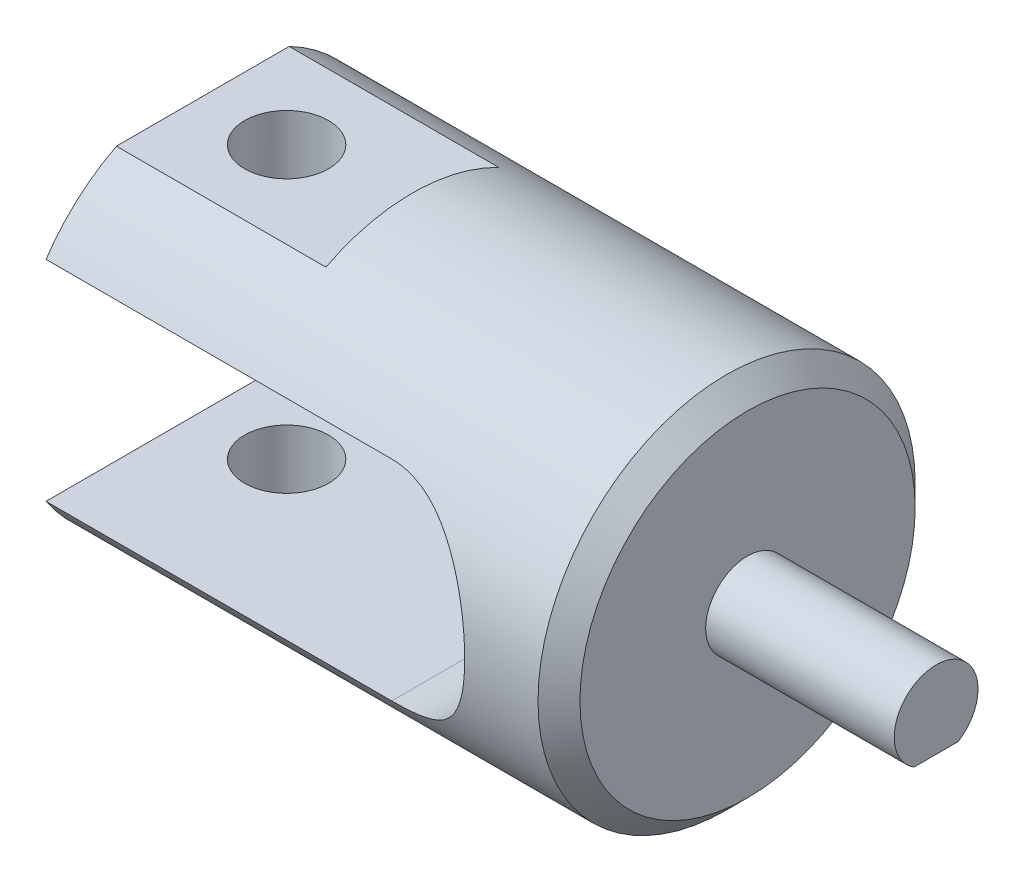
ISO-10303-21;
HEADER;
FILE_DESCRIPTION(('STEP AP214'),'2;1');
FILE_NAME('part.step','',(''),(''),'','','');
FILE_SCHEMA(('AUTOMOTIVE_DESIGN { 1 0 10303 214 1 1 1 1 }'));
ENDSEC;
DATA;
#1=APPLICATION_CONTEXT('core data for automotive mechanical design processes');
#2=APPLICATION_PROTOCOL_DEFINITION('international standard','automotive_design',2000,#1);
#3=PRODUCT_CONTEXT('',#1,'mechanical');
#4=PRODUCT('Part','Part','',(#3));
#5=PRODUCT_RELATED_PRODUCT_CATEGORY('part','',(#4));
#6=PRODUCT_DEFINITION_FORMATION('','',#4);
#7=PRODUCT_DEFINITION_CONTEXT('part definition',#1,'design');
#8=PRODUCT_DEFINITION('design','',#6,#7);
#9=PRODUCT_DEFINITION_SHAPE('','',#8);
#10=(LENGTH_UNIT() NAMED_UNIT(*) SI_UNIT(.MILLI.,.METRE.));
#11=(NAMED_UNIT(*) PLANE_ANGLE_UNIT() SI_UNIT($,.RADIAN.));
#12=(NAMED_UNIT(*) SI_UNIT($,.STERADIAN.) SOLID_ANGLE_UNIT());
#13=UNCERTAINTY_MEASURE_WITH_UNIT(LENGTH_MEASURE(1.E-05),#10,'distance_accuracy_value','');
#14=(GEOMETRIC_REPRESENTATION_CONTEXT(3) GLOBAL_UNCERTAINTY_ASSIGNED_CONTEXT((#13)) GLOBAL_UNIT_ASSIGNED_CONTEXT((#10,
#11,#12)) REPRESENTATION_CONTEXT('',''));
#15=CARTESIAN_POINT('',(0.,0.,0.));
#16=DIRECTION('',(0.,0.,1.));
#17=DIRECTION('',(1.,0.,0.));
#18=AXIS2_PLACEMENT_3D('',#15,#16,#17);
#19=CARTESIAN_POINT('',(-46.1378907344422,0.,0.));
#20=DIRECTION('',(1.,0.,0.));
#21=DIRECTION('',(0.,0.,-1.));
#22=AXIS2_PLACEMENT_3D('',#19,#20,#21);
#23=PLANE('',#22);
#24=DIRECTION('',(0.,0.,-1.));
#25=VECTOR('',#24,1.);
#26=CARTESIAN_POINT('',(-46.1378907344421,-8.,9.));
#27=LINE('',#26,#25);
#28=CARTESIAN_POINT('',(-46.1378907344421,-8.,4.12310562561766));
#29=VERTEX_POINT('',#28);
#30=CARTESIAN_POINT('',(-46.1378907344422,-8.,-4.12310562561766));
#31=VERTEX_POINT('',#30);
#32=EDGE_CURVE('E59',#29,#31,#27,.T.);
#33=ORIENTED_EDGE('',*,*,#32,.F.);
#34=CARTESIAN_POINT('',(-46.1378907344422,0.,0.));
#35=DIRECTION('',(-1.,0.,0.));
#36=DIRECTION('',(0.,0.,1.));
#37=AXIS2_PLACEMENT_3D('',#34,#35,#36);
#38=CIRCLE('',#37,9.);
#39=CARTESIAN_POINT('',(-46.1378907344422,-5.,7.48331477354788));
#40=VERTEX_POINT('',#39);
#41=EDGE_CURVE('E145',#29,#40,#38,.T.);
#42=ORIENTED_EDGE('',*,*,#41,.T.);
#43=DIRECTION('',(0.,0.,-1.));
#44=VECTOR('',#43,1.);
#45=CARTESIAN_POINT('',(-46.1378907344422,-5.,9.));
#46=LINE('',#45,#44);
#47=CARTESIAN_POINT('',(-46.1378907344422,-5.,-7.48331477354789));
#48=VERTEX_POINT('',#47);
#49=EDGE_CURVE('E142',#40,#48,#46,.T.);
#50=ORIENTED_EDGE('',*,*,#49,.T.);
#51=EDGE_CURVE('E152',#48,#31,#38,.T.);
#52=ORIENTED_EDGE('',*,*,#51,.T.);
#53=EDGE_LOOP('',(#33,#42,#50,#52));
#54=FACE_BOUND('',#53,.T.);
#55=ADVANCED_FACE('F43',(#54),#23,.F.);
#56=CARTESIAN_POINT('',(-64.5427213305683,0.,0.));
#57=DIRECTION('',(-1.,0.,0.));
#58=DIRECTION('',(0.,0.,1.));
#59=AXIS2_PLACEMENT_3D('',#56,#57,#58);
#60=CYLINDRICAL_SURFACE('',#59,9.);
#61=CARTESIAN_POINT('',(-21.1378907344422,0.,0.));
#62=DIRECTION('',(-1.,0.,0.));
#63=DIRECTION('',(0.,0.,1.));
#64=AXIS2_PLACEMENT_3D('',#61,#62,#63);
#65=CIRCLE('',#64,9.);
#66=CARTESIAN_POINT('',(-21.1378907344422,0.,9.));
#67=VERTEX_POINT('',#66);
#68=EDGE_CURVE('E157',#67,#67,#65,.T.);
#69=ORIENTED_EDGE('',*,*,#68,.T.);
#70=EDGE_LOOP('',(#69));
#71=FACE_BOUND('',#70,.T.);
#72=DIRECTION('',(-1.,0.,0.));
#73=VECTOR('',#72,1.);
#74=CARTESIAN_POINT('',(-64.5427213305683,8.,-4.12310562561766));
#75=LINE('',#74,#73);
#76=CARTESIAN_POINT('',(-36.1378907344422,8.,-4.12310562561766));
#77=VERTEX_POINT('',#76);
#78=CARTESIAN_POINT('',(-46.1378907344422,8.,-4.12310562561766));
#79=VERTEX_POINT('',#78);
#80=EDGE_CURVE('E67',#77,#79,#75,.T.);
#81=ORIENTED_EDGE('',*,*,#80,.F.);
#82=CARTESIAN_POINT('',(-36.1378907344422,0.,0.));
#83=DIRECTION('',(-1.,0.,0.));
#84=DIRECTION('',(0.,0.,1.));
#85=AXIS2_PLACEMENT_3D('',#82,#83,#84);
#86=CIRCLE('',#85,9.);
#87=CARTESIAN_POINT('',(-36.1378907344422,8.,4.12310562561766));
#88=VERTEX_POINT('',#87);
#89=EDGE_CURVE('E11',#88,#77,#86,.T.);
#90=ORIENTED_EDGE('',*,*,#89,.F.);
#91=DIRECTION('',(-1.,0.,0.));
#92=VECTOR('',#91,1.);
#93=CARTESIAN_POINT('',(-64.5427213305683,8.,4.12310562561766));
#94=LINE('',#93,#92);
#95=CARTESIAN_POINT('',(-46.1378907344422,8.,4.12310562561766));
#96=VERTEX_POINT('',#95);
#97=EDGE_CURVE('E138',#96,#88,#94,.F.);
#98=ORIENTED_EDGE('',*,*,#97,.F.);
#99=CARTESIAN_POINT('',(-46.1378907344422,5.,7.48331477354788));
#100=VERTEX_POINT('',#99);
#101=EDGE_CURVE('E156',#100,#96,#38,.T.);
#102=ORIENTED_EDGE('',*,*,#101,.F.);
#103=DIRECTION('',(-1.,0.,0.));
#104=VECTOR('',#103,1.);
#105=CARTESIAN_POINT('',(-64.5427213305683,5.,7.48331477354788));
#106=LINE('',#105,#104);
#107=CARTESIAN_POINT('',(-29.6378907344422,5.,7.48331477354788));
#108=VERTEX_POINT('',#107);
#109=EDGE_CURVE('E194',#100,#108,#106,.F.);
#110=ORIENTED_EDGE('',*,*,#109,.T.);
#111=CARTESIAN_POINT('',(-29.6378907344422,-5.,7.48331477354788));
#112=CARTESIAN_POINT('',(-29.5093229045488,-5.0000260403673,7.48326859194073));
#113=CARTESIAN_POINT('',(-29.3807814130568,-4.99504209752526,7.48662687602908));
#114=CARTESIAN_POINT('',(-29.1248882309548,-4.97526019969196,7.4998027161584));
#115=CARTESIAN_POINT('',(-28.9975356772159,-4.96047003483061,7.50961514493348));
#116=CARTESIAN_POINT('',(-28.7458250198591,-4.92141678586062,7.53526150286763));
#117=CARTESIAN_POINT('',(-28.6214522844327,-4.89722003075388,7.55105325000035));
#118=CARTESIAN_POINT('',(-28.3756738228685,-4.83970606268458,7.58804415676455));
#119=CARTESIAN_POINT('',(-28.2542685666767,-4.80638741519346,7.60924416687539));
#120=CARTESIAN_POINT('',(-27.8963577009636,-4.6935499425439,7.67974459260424));
#121=CARTESIAN_POINT('',(-27.6652021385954,-4.60099757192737,7.73605188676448));
#122=CARTESIAN_POINT('',(-27.2215227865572,-4.38433400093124,7.86086499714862));
#123=CARTESIAN_POINT('',(-27.0090360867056,-4.26016180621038,7.92939431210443));
#124=CARTESIAN_POINT('',(-26.5850434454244,-3.96898700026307,8.07939590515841));
#125=CARTESIAN_POINT('',(-26.3758705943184,-3.79889880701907,8.16147484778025));
#126=CARTESIAN_POINT('',(-25.9871175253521,-3.42697747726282,8.32448014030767));
#127=CARTESIAN_POINT('',(-25.807546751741,-3.22513424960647,8.40540611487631));
#128=CARTESIAN_POINT('',(-25.5562317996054,-2.89167175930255,8.52372398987));
#129=CARTESIAN_POINT('',(-25.4726138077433,-2.7699109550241,8.5641638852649));
#130=CARTESIAN_POINT('',(-25.3160459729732,-2.51863945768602,8.64139436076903));
#131=CARTESIAN_POINT('',(-25.2430918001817,-2.38913194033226,8.67818642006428));
#132=CARTESIAN_POINT('',(-25.1086128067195,-2.12316815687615,8.74705813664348));
#133=CARTESIAN_POINT('',(-25.0470842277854,-1.98671419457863,8.77913934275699));
#134=CARTESIAN_POINT('',(-24.9361883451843,-1.70777879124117,8.83763452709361));
#135=CARTESIAN_POINT('',(-24.8868193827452,-1.56529817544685,8.8640492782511));
#136=CARTESIAN_POINT('',(-24.8045793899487,-1.28773017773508,8.90841205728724));
#137=CARTESIAN_POINT('',(-24.7706668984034,-1.15303519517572,8.92688686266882));
#138=CARTESIAN_POINT('',(-24.7140885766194,-0.880633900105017,8.95786054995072));
#139=CARTESIAN_POINT('',(-24.6914213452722,-0.742927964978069,8.97036017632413));
#140=CARTESIAN_POINT('',(-24.6576751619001,-0.465759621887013,8.98901270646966));
#141=CARTESIAN_POINT('',(-24.646589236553,-0.326298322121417,8.99516942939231));
#142=CARTESIAN_POINT('',(-24.636155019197,-0.0468065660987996,9.00096328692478));
#143=CARTESIAN_POINT('',(-24.6368057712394,0.0932238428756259,9.0006009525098));
#144=CARTESIAN_POINT('',(-24.649131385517,0.357590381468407,8.99375894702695));
#145=CARTESIAN_POINT('',(-24.6596180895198,0.482001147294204,8.98793860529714));
#146=CARTESIAN_POINT('',(-24.6898086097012,0.729395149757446,8.97125177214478));
#147=CARTESIAN_POINT('',(-24.7095152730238,0.852377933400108,8.9603837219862));
#148=CARTESIAN_POINT('',(-24.7579099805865,1.09599276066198,8.93385701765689));
#149=CARTESIAN_POINT('',(-24.7865948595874,1.21662561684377,8.91820005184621));
#150=CARTESIAN_POINT('',(-24.8526276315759,1.45484047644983,8.88245355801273));
#151=CARTESIAN_POINT('',(-24.8899788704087,1.57242128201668,8.86236231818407));
#152=CARTESIAN_POINT('',(-25.0153237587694,1.92181769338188,8.79562516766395));
#153=CARTESIAN_POINT('',(-25.1161490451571,2.14800182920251,8.74277574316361));
#154=CARTESIAN_POINT('',(-25.3482251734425,2.58053942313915,8.62503637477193));
#155=CARTESIAN_POINT('',(-25.4794855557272,2.78688663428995,8.56014265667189));
#156=CARTESIAN_POINT('',(-25.7850579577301,3.1981577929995,8.41571482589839));
#157=CARTESIAN_POINT('',(-25.9625049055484,3.40046918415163,8.33535585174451));
#158=CARTESIAN_POINT('',(-26.3471840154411,3.77403812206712,8.17301914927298));
#159=CARTESIAN_POINT('',(-26.5544538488,3.94525576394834,8.0910394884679));
#160=CARTESIAN_POINT('',(-27.0159520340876,4.26749402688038,7.92616967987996));
#161=CARTESIAN_POINT('',(-27.2727427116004,4.4152277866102,7.84388404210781));
#162=CARTESIAN_POINT('',(-27.6771591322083,4.60191103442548,7.73483155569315));
#163=CARTESIAN_POINT('',(-27.8150512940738,4.6582879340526,7.70089820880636));
#164=CARTESIAN_POINT('',(-28.0965653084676,4.75884511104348,7.63916714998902));
#165=CARTESIAN_POINT('',(-28.2401847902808,4.8030303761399,7.61136692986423));
#166=CARTESIAN_POINT('',(-28.4871153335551,4.86689070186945,7.57062300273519));
#167=CARTESIAN_POINT('',(-28.5892544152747,4.88992539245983,7.55573898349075));
#168=CARTESIAN_POINT('',(-28.7952426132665,4.92959817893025,7.52991502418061));
#169=CARTESIAN_POINT('',(-28.8990912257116,4.94623812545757,7.51897394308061));
#170=CARTESIAN_POINT('',(-29.1084197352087,4.97301033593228,7.5012960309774));
#171=CARTESIAN_POINT('',(-29.2139045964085,4.9831154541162,7.49457674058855));
#172=CARTESIAN_POINT('',(-29.4255528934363,4.9966186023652,7.48557373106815));
#173=CARTESIAN_POINT('',(-29.5317166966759,5.00001262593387,7.48329266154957));
#174=CARTESIAN_POINT('',(-29.6378907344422,5.,7.48331477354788));
#175=B_SPLINE_CURVE_WITH_KNOTS('',3,(#111,#112,#113,#114,#115,#116,#117,#118,#119,#120,#121,
#122,#123,#124,#125,#126,#127,#128,#129,#130,#131,#132,#133,#134,#135,#136,#137,#138,#139,#140,
#141,#142,#143,#144,#145,#146,#147,#148,#149,#150,#151,#152,#153,#154,#155,#156,#157,#158,#159,
#160,#161,#162,#163,#164,#165,#166,#167,#168,#169,#170,#171,#172,#173,#174),.UNSPECIFIED.,.F.,
.F.,(4,2,2,2,2,2,2,2,2,2,2,2,2,2,2,2,2,2,2,2,2,2,2,2,2,2,2,2,2,2,2,4),(0.,0.385520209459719,
0.770734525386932,1.15328044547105,1.53588656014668,2.29821751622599,3.06203029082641,
3.90413600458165,4.74650986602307,5.20542721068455,5.66415769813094,6.12273702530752,
6.58125376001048,7.00103186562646,7.42075765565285,7.84023057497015,8.25966932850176,
8.63418575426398,9.00881790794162,9.38331813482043,9.75796318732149,10.5142083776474,
11.2706909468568,12.1097247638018,12.9498278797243,13.8668877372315,14.3246833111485,
14.7822913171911,15.0993117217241,15.416240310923,15.7344771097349,16.05290383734),.UNSPECIFIED.);
#176=CARTESIAN_POINT('',(-29.6378907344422,-5.,7.48331477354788));
#177=VERTEX_POINT('',#176);
#178=EDGE_CURVE('E187',#177,#108,#175,.T.);
#179=ORIENTED_EDGE('',*,*,#178,.F.);
#180=DIRECTION('',(-1.,0.,0.));
#181=VECTOR('',#180,1.);
#182=CARTESIAN_POINT('',(-64.5427213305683,-5.,7.48331477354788));
#183=LINE('',#182,#181);
#184=EDGE_CURVE('E133',#40,#177,#183,.F.);
#185=ORIENTED_EDGE('',*,*,#184,.F.);
#186=ORIENTED_EDGE('',*,*,#41,.F.);
#187=DIRECTION('',(-1.,0.,0.));
#188=VECTOR('',#187,1.);
#189=CARTESIAN_POINT('',(-64.5427213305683,-8.,4.12310562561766));
#190=LINE('',#189,#188);
#191=CARTESIAN_POINT('',(-36.137890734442,-8.,4.12310562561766));
#192=VERTEX_POINT('',#191);
#193=EDGE_CURVE('E52',#192,#29,#190,.T.);
#194=ORIENTED_EDGE('',*,*,#193,.F.);
#195=CARTESIAN_POINT('',(-36.137890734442,0.,0.));
#196=DIRECTION('',(-1.,0.,0.));
#197=DIRECTION('',(0.,0.,1.));
#198=AXIS2_PLACEMENT_3D('',#195,#196,#197);
#199=CIRCLE('',#198,9.);
#200=CARTESIAN_POINT('',(-36.137890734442,-8.,-4.12310562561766));
#201=VERTEX_POINT('',#200);
#202=EDGE_CURVE('E207',#201,#192,#199,.T.);
#203=ORIENTED_EDGE('',*,*,#202,.F.);
#204=DIRECTION('',(-1.,0.,0.));
#205=VECTOR('',#204,1.);
#206=CARTESIAN_POINT('',(-64.5427213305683,-8.,-4.12310562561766));
#207=LINE('',#206,#205);
#208=EDGE_CURVE('E205',#31,#201,#207,.F.);
#209=ORIENTED_EDGE('',*,*,#208,.F.);
#210=ORIENTED_EDGE('',*,*,#51,.F.);
#211=DIRECTION('',(-1.,0.,0.));
#212=VECTOR('',#211,1.);
#213=CARTESIAN_POINT('',(-64.5427213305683,-5.,-7.48331477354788));
#214=LINE('',#213,#212);
#215=CARTESIAN_POINT('',(-29.6378907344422,-5.,-7.48331477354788));
#216=VERTEX_POINT('',#215);
#217=EDGE_CURVE('E171',#216,#48,#214,.T.);
#218=ORIENTED_EDGE('',*,*,#217,.F.);
#219=CARTESIAN_POINT('',(-29.6378907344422,5.,-7.48331477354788));
#220=CARTESIAN_POINT('',(-29.5093229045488,5.0000260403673,-7.48326859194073));
#221=CARTESIAN_POINT('',(-29.3807814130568,4.99504209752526,-7.48662687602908));
#222=CARTESIAN_POINT('',(-29.1248882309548,4.97526019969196,-7.4998027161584));
#223=CARTESIAN_POINT('',(-28.9975356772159,4.96047003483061,-7.50961514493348));
#224=CARTESIAN_POINT('',(-28.7458250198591,4.92141678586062,-7.53526150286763));
#225=CARTESIAN_POINT('',(-28.6214522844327,4.89722003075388,-7.55105325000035));
#226=CARTESIAN_POINT('',(-28.3756738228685,4.83970606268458,-7.58804415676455));
#227=CARTESIAN_POINT('',(-28.2542685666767,4.80638741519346,-7.60924416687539));
#228=CARTESIAN_POINT('',(-27.8963577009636,4.6935499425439,-7.67974459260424));
#229=CARTESIAN_POINT('',(-27.6652021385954,4.60099757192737,-7.73605188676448));
#230=CARTESIAN_POINT('',(-27.2215227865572,4.38433400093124,-7.86086499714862));
#231=CARTESIAN_POINT('',(-27.0090360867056,4.26016180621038,-7.92939431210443));
#232=CARTESIAN_POINT('',(-26.5850434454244,3.96898700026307,-8.07939590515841));
#233=CARTESIAN_POINT('',(-26.3758705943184,3.79889880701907,-8.16147484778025));
#234=CARTESIAN_POINT('',(-25.9871175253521,3.42697747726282,-8.32448014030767));
#235=CARTESIAN_POINT('',(-25.807546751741,3.22513424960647,-8.40540611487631));
#236=CARTESIAN_POINT('',(-25.5562317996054,2.89167175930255,-8.52372398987));
#237=CARTESIAN_POINT('',(-25.4726138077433,2.7699109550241,-8.5641638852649));
#238=CARTESIAN_POINT('',(-25.3160459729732,2.51863945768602,-8.64139436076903));
#239=CARTESIAN_POINT('',(-25.2430918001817,2.38913194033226,-8.67818642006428));
#240=CARTESIAN_POINT('',(-25.1086128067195,2.12316815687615,-8.74705813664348));
#241=CARTESIAN_POINT('',(-25.0470842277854,1.98671419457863,-8.77913934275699));
#242=CARTESIAN_POINT('',(-24.9361883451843,1.70777879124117,-8.83763452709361));
#243=CARTESIAN_POINT('',(-24.8868193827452,1.56529817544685,-8.8640492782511));
#244=CARTESIAN_POINT('',(-24.8045793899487,1.28773017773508,-8.90841205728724));
#245=CARTESIAN_POINT('',(-24.7706668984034,1.15303519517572,-8.92688686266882));
#246=CARTESIAN_POINT('',(-24.7140885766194,0.880633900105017,-8.95786054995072));
#247=CARTESIAN_POINT('',(-24.6914213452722,0.742927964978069,-8.97036017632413));
#248=CARTESIAN_POINT('',(-24.6576751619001,0.465759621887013,-8.98901270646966));
#249=CARTESIAN_POINT('',(-24.646589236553,0.326298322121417,-8.99516942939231));
#250=CARTESIAN_POINT('',(-24.636155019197,0.0468065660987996,-9.00096328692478));
#251=CARTESIAN_POINT('',(-24.6368057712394,-0.0932238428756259,-9.0006009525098));
#252=CARTESIAN_POINT('',(-24.649131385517,-0.357590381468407,-8.99375894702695));
#253=CARTESIAN_POINT('',(-24.6596180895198,-0.482001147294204,-8.98793860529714));
#254=CARTESIAN_POINT('',(-24.6898086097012,-0.729395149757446,-8.97125177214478));
#255=CARTESIAN_POINT('',(-24.7095152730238,-0.852377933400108,-8.9603837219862));
#256=CARTESIAN_POINT('',(-24.7579099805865,-1.09599276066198,-8.93385701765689));
#257=CARTESIAN_POINT('',(-24.7865948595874,-1.21662561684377,-8.91820005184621));
#258=CARTESIAN_POINT('',(-24.8526276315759,-1.45484047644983,-8.88245355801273));
#259=CARTESIAN_POINT('',(-24.8899788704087,-1.57242128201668,-8.86236231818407));
#260=CARTESIAN_POINT('',(-25.0153237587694,-1.92181769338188,-8.79562516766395));
#261=CARTESIAN_POINT('',(-25.1161490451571,-2.14800182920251,-8.74277574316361));
#262=CARTESIAN_POINT('',(-25.3482251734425,-2.58053942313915,-8.62503637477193));
#263=CARTESIAN_POINT('',(-25.4794855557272,-2.78688663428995,-8.56014265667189));
#264=CARTESIAN_POINT('',(-25.7850579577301,-3.1981577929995,-8.41571482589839));
#265=CARTESIAN_POINT('',(-25.9625049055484,-3.40046918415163,-8.33535585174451));
#266=CARTESIAN_POINT('',(-26.3471840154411,-3.77403812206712,-8.17301914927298));
#267=CARTESIAN_POINT('',(-26.5544538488,-3.94525576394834,-8.0910394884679));
#268=CARTESIAN_POINT('',(-27.0159520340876,-4.26749402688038,-7.92616967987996));
#269=CARTESIAN_POINT('',(-27.2727427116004,-4.4152277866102,-7.84388404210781));
#270=CARTESIAN_POINT('',(-27.6771591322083,-4.60191103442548,-7.73483155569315));
#271=CARTESIAN_POINT('',(-27.8150512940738,-4.6582879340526,-7.70089820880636));
#272=CARTESIAN_POINT('',(-28.0965653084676,-4.75884511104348,-7.63916714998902));
#273=CARTESIAN_POINT('',(-28.2401847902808,-4.8030303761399,-7.61136692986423));
#274=CARTESIAN_POINT('',(-28.4871153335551,-4.86689070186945,-7.57062300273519));
#275=CARTESIAN_POINT('',(-28.5892544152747,-4.88992539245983,-7.55573898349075));
#276=CARTESIAN_POINT('',(-28.7952426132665,-4.92959817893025,-7.52991502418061));
#277=CARTESIAN_POINT('',(-28.8990912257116,-4.94623812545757,-7.51897394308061));
#278=CARTESIAN_POINT('',(-29.1084197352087,-4.97301033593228,-7.5012960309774));
#279=CARTESIAN_POINT('',(-29.2139045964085,-4.9831154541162,-7.49457674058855));
#280=CARTESIAN_POINT('',(-29.4255528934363,-4.9966186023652,-7.48557373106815));
#281=CARTESIAN_POINT('',(-29.5317166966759,-5.00001262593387,-7.48329266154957));
#282=CARTESIAN_POINT('',(-29.6378907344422,-5.,-7.48331477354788));
#283=B_SPLINE_CURVE_WITH_KNOTS('',3,(#219,#220,#221,#222,#223,#224,#225,#226,#227,#228,#229,
#230,#231,#232,#233,#234,#235,#236,#237,#238,#239,#240,#241,#242,#243,#244,#245,#246,#247,#248,
#249,#250,#251,#252,#253,#254,#255,#256,#257,#258,#259,#260,#261,#262,#263,#264,#265,#266,#267,
#268,#269,#270,#271,#272,#273,#274,#275,#276,#277,#278,#279,#280,#281,#282),.UNSPECIFIED.,.F.,
.F.,(4,2,2,2,2,2,2,2,2,2,2,2,2,2,2,2,2,2,2,2,2,2,2,2,2,2,2,2,2,2,2,4),(0.,0.385520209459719,
0.770734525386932,1.15328044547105,1.53588656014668,2.29821751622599,3.06203029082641,
3.90413600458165,4.74650986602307,5.20542721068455,5.66415769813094,6.12273702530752,
6.58125376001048,7.00103186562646,7.42075765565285,7.84023057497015,8.25966932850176,
8.63418575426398,9.00881790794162,9.38331813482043,9.75796318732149,10.5142083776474,
11.2706909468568,12.1097247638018,12.9498278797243,13.8668877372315,14.3246833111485,
14.7822913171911,15.0993117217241,15.416240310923,15.7344771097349,16.05290383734),.UNSPECIFIED.);
#284=CARTESIAN_POINT('',(-29.6378907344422,5.,-7.48331477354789));
#285=VERTEX_POINT('',#284);
#286=EDGE_CURVE('E163',#285,#216,#283,.T.);
#287=ORIENTED_EDGE('',*,*,#286,.F.);
#288=DIRECTION('',(-1.,0.,0.));
#289=VECTOR('',#288,1.);
#290=CARTESIAN_POINT('',(-64.5427213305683,5.,-7.48331477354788));
#291=LINE('',#290,#289);
#292=CARTESIAN_POINT('',(-46.1378907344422,5.,-7.48331477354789));
#293=VERTEX_POINT('',#292);
#294=EDGE_CURVE('E197',#285,#293,#291,.T.);
#295=ORIENTED_EDGE('',*,*,#294,.T.);
#296=EDGE_CURVE('E155',#79,#293,#38,.T.);
#297=ORIENTED_EDGE('',*,*,#296,.F.);
#298=EDGE_LOOP('',(#81,#90,#98,#102,#110,#179,#185,#186,#194,#203,#209,#210,#218,#287,#295,#297));
#299=FACE_BOUND('',#298,.T.);
#300=ADVANCED_FACE('F173',(#71,#299),#60,.T.);
#301=DIRECTION('',(0.,0.,1.));
#302=VECTOR('',#301,1.);
#303=CARTESIAN_POINT('',(-46.1378907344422,8.,0.));
#304=LINE('',#303,#302);
#305=EDGE_CURVE('E203',#79,#96,#304,.T.);
#306=ORIENTED_EDGE('',*,*,#305,.F.);
#307=ORIENTED_EDGE('',*,*,#296,.T.);
#308=DIRECTION('',(0.,0.,-1.));
#309=VECTOR('',#308,1.);
#310=CARTESIAN_POINT('',(-46.1378907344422,5.,9.));
#311=LINE('',#310,#309);
#312=EDGE_CURVE('E229',#100,#293,#311,.T.);
#313=ORIENTED_EDGE('',*,*,#312,.F.);
#314=ORIENTED_EDGE('',*,*,#101,.T.);
#315=EDGE_LOOP('',(#306,#307,#313,#314));
#316=FACE_BOUND('',#315,.T.);
#317=ADVANCED_FACE('F228',(#316),#23,.F.);
#318=CARTESIAN_POINT('',(-64.5427213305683,0.,0.));
#319=DIRECTION('',(-1.,0.,0.));
#320=DIRECTION('',(0.,0.,1.));
#321=AXIS2_PLACEMENT_3D('',#318,#319,#320);
#322=CYLINDRICAL_SURFACE('',#321,2.);
#323=CARTESIAN_POINT('',(-20.1378907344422,0.,0.));
#324=DIRECTION('',(-1.,0.,0.));
#325=DIRECTION('',(0.,0.,1.));
#326=AXIS2_PLACEMENT_3D('',#323,#324,#325);
#327=CIRCLE('',#326,2.);
#328=CARTESIAN_POINT('',(-20.1378907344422,0.,2.));
#329=VERTEX_POINT('',#328);
#330=EDGE_CURVE('E141',#329,#329,#327,.T.);
#331=ORIENTED_EDGE('',*,*,#330,.F.);
#332=EDGE_LOOP('',(#331));
#333=FACE_BOUND('',#332,.T.);
#334=DIRECTION('',(-1.,0.,0.));
#335=VECTOR('',#334,1.);
#336=CARTESIAN_POINT('',(-64.5427213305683,-1.7,1.05356537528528));
#337=LINE('',#336,#335);
#338=CARTESIAN_POINT('',(-11.1378907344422,-1.7,1.05356537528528));
#339=VERTEX_POINT('',#338);
#340=CARTESIAN_POINT('',(-18.1378907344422,-1.7,1.05356537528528));
#341=VERTEX_POINT('',#340);
#342=EDGE_CURVE('E125',#339,#341,#337,.T.);
#343=ORIENTED_EDGE('',*,*,#342,.F.);
#344=CARTESIAN_POINT('',(-11.1378907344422,0.,0.));
#345=DIRECTION('',(-1.,0.,0.));
#346=DIRECTION('',(0.,0.,1.));
#347=AXIS2_PLACEMENT_3D('',#344,#345,#346);
#348=CIRCLE('',#347,2.);
#349=CARTESIAN_POINT('',(-11.1378907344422,-1.7,-1.05356537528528));
#350=VERTEX_POINT('',#349);
#351=EDGE_CURVE('E137',#339,#350,#348,.T.);
#352=ORIENTED_EDGE('',*,*,#351,.T.);
#353=DIRECTION('',(-1.,0.,0.));
#354=VECTOR('',#353,1.);
#355=CARTESIAN_POINT('',(-64.5427213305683,-1.7,-1.05356537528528));
#356=LINE('',#355,#354);
#357=CARTESIAN_POINT('',(-18.1378907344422,-1.7,-1.05356537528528));
#358=VERTEX_POINT('',#357);
#359=EDGE_CURVE('E128',#358,#350,#356,.F.);
#360=ORIENTED_EDGE('',*,*,#359,.F.);
#361=CARTESIAN_POINT('',(-18.1378907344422,0.,0.));
#362=DIRECTION('',(1.,0.,0.));
#363=DIRECTION('',(0.,0.,-1.));
#364=AXIS2_PLACEMENT_3D('',#361,#362,#363);
#365=CIRCLE('',#364,2.);
#366=EDGE_CURVE('E132',#341,#358,#365,.T.);
#367=ORIENTED_EDGE('',*,*,#366,.F.);
#368=EDGE_LOOP('',(#343,#352,#360,#367));
#369=FACE_BOUND('',#368,.T.);
#370=ADVANCED_FACE('F136',(#333,#369),#322,.T.);
#371=CARTESIAN_POINT('',(-11.1378907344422,2.,0.));
#372=DIRECTION('',(-1.,0.,0.));
#373=DIRECTION('',(0.,0.,1.));
#374=AXIS2_PLACEMENT_3D('',#371,#372,#373);
#375=PLANE('',#374);
#376=DIRECTION('',(0.,0.,1.));
#377=VECTOR('',#376,1.);
#378=CARTESIAN_POINT('',(-11.1378907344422,-1.7,0.));
#379=LINE('',#378,#377);
#380=EDGE_CURVE('E121',#350,#339,#379,.T.);
#381=ORIENTED_EDGE('',*,*,#380,.F.);
#382=ORIENTED_EDGE('',*,*,#351,.F.);
#383=EDGE_LOOP('',(#381,#382));
#384=FACE_BOUND('',#383,.T.);
#385=ADVANCED_FACE('F140',(#384),#375,.F.);
#386=CARTESIAN_POINT('',(-20.1378907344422,9.,0.));
#387=DIRECTION('',(-1.,0.,0.));
#388=DIRECTION('',(0.,0.,1.));
#389=AXIS2_PLACEMENT_3D('',#386,#387,#388);
#390=PLANE('',#389);
#391=CARTESIAN_POINT('',(-20.1378907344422,0.,0.));
#392=DIRECTION('',(-1.,0.,0.));
#393=DIRECTION('',(0.,0.,1.));
#394=AXIS2_PLACEMENT_3D('',#391,#392,#393);
#395=CIRCLE('',#394,8.);
#396=CARTESIAN_POINT('',(-20.1378907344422,0.,8.));
#397=VERTEX_POINT('',#396);
#398=EDGE_CURVE('E160',#397,#397,#395,.F.);
#399=ORIENTED_EDGE('',*,*,#398,.T.);
#400=EDGE_LOOP('',(#399));
#401=FACE_BOUND('',#400,.T.);
#402=ORIENTED_EDGE('',*,*,#330,.T.);
#403=EDGE_LOOP('',(#402));
#404=FACE_BOUND('',#403,.T.);
#405=ADVANCED_FACE('F293',(#401,#404),#390,.F.);
#406=CARTESIAN_POINT('',(-21.1378907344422,0.,0.));
#407=DIRECTION('',(-1.,0.,0.));
#408=DIRECTION('',(0.,0.,1.));
#409=AXIS2_PLACEMENT_3D('',#406,#407,#408);
#410=CONICAL_SURFACE('',#409,9.,0.785398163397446);
#411=ORIENTED_EDGE('',*,*,#398,.F.);
#412=EDGE_LOOP('',(#411));
#413=FACE_BOUND('',#412,.T.);
#414=ORIENTED_EDGE('',*,*,#68,.F.);
#415=EDGE_LOOP('',(#414));
#416=FACE_BOUND('',#415,.T.);
#417=ADVANCED_FACE('F46',(#413,#416),#410,.T.);
#418=CARTESIAN_POINT('',(-46.1378907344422,-5.,9.));
#419=DIRECTION('',(0.,1.,0.));
#420=DIRECTION('',(-1.,0.,0.));
#421=AXIS2_PLACEMENT_3D('',#418,#419,#420);
#422=PLANE('',#421);
#423=CARTESIAN_POINT('',(-42.1378907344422,-5.,0.));
#424=DIRECTION('',(0.,1.,0.));
#425=DIRECTION('',(-1.,0.,0.));
#426=AXIS2_PLACEMENT_3D('',#423,#424,#425);
#427=CIRCLE('',#426,2.);
#428=CARTESIAN_POINT('',(-44.1378907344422,-5.,0.));
#429=VERTEX_POINT('',#428);
#430=EDGE_CURVE('E219',#429,#429,#427,.T.);
#431=ORIENTED_EDGE('',*,*,#430,.F.);
#432=EDGE_LOOP('',(#431));
#433=FACE_BOUND('',#432,.T.);
#434=ORIENTED_EDGE('',*,*,#217,.T.);
#435=ORIENTED_EDGE('',*,*,#49,.F.);
#436=ORIENTED_EDGE('',*,*,#184,.T.);
#437=DIRECTION('',(0.,0.,-1.));
#438=VECTOR('',#437,1.);
#439=CARTESIAN_POINT('',(-29.6378907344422,-5.,9.));
#440=LINE('',#439,#438);
#441=EDGE_CURVE('E148',#177,#216,#440,.T.);
#442=ORIENTED_EDGE('',*,*,#441,.T.);
#443=EDGE_LOOP('',(#434,#435,#436,#442));
#444=FACE_BOUND('',#443,.T.);
#445=ADVANCED_FACE('F182',(#433,#444),#422,.T.);
#446=CARTESIAN_POINT('',(-29.6378907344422,0.,9.));
#447=DIRECTION('',(0.,0.,-1.));
#448=DIRECTION('',(-1.,0.,0.));
#449=AXIS2_PLACEMENT_3D('',#446,#447,#448);
#450=CYLINDRICAL_SURFACE('',#449,5.);
#451=ORIENTED_EDGE('',*,*,#441,.F.);
#452=ORIENTED_EDGE('',*,*,#178,.T.);
#453=DIRECTION('',(0.,0.,-1.));
#454=VECTOR('',#453,1.);
#455=CARTESIAN_POINT('',(-29.6378907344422,5.,9.));
#456=LINE('',#455,#454);
#457=EDGE_CURVE('E238',#108,#285,#456,.T.);
#458=ORIENTED_EDGE('',*,*,#457,.T.);
#459=ORIENTED_EDGE('',*,*,#286,.T.);
#460=EDGE_LOOP('',(#451,#452,#458,#459));
#461=FACE_BOUND('',#460,.T.);
#462=ADVANCED_FACE('F176',(#461),#450,.F.);
#463=CARTESIAN_POINT('',(-46.1378907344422,5.,9.));
#464=DIRECTION('',(0.,1.,0.));
#465=DIRECTION('',(-1.,0.,0.));
#466=AXIS2_PLACEMENT_3D('',#463,#464,#465);
#467=PLANE('',#466);
#468=CARTESIAN_POINT('',(-42.1378907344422,5.,0.));
#469=DIRECTION('',(0.,1.,0.));
#470=DIRECTION('',(-1.,0.,0.));
#471=AXIS2_PLACEMENT_3D('',#468,#469,#470);
#472=CIRCLE('',#471,2.);
#473=CARTESIAN_POINT('',(-44.1378907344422,5.,0.));
#474=VERTEX_POINT('',#473);
#475=EDGE_CURVE('E255',#474,#474,#472,.T.);
#476=ORIENTED_EDGE('',*,*,#475,.T.);
#477=EDGE_LOOP('',(#476));
#478=FACE_BOUND('',#477,.T.);
#479=ORIENTED_EDGE('',*,*,#457,.F.);
#480=ORIENTED_EDGE('',*,*,#109,.F.);
#481=ORIENTED_EDGE('',*,*,#312,.T.);
#482=ORIENTED_EDGE('',*,*,#294,.F.);
#483=EDGE_LOOP('',(#479,#480,#481,#482));
#484=FACE_BOUND('',#483,.T.);
#485=ADVANCED_FACE('F181',(#478,#484),#467,.F.);
#486=CARTESIAN_POINT('',(-18.1378907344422,-1.7,9.));
#487=DIRECTION('',(1.,0.,0.));
#488=DIRECTION('',(0.,0.,-1.));
#489=AXIS2_PLACEMENT_3D('',#486,#487,#488);
#490=PLANE('',#489);
#491=DIRECTION('',(0.,0.,-1.));
#492=VECTOR('',#491,1.);
#493=CARTESIAN_POINT('',(-18.1378907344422,-1.7,9.));
#494=LINE('',#493,#492);
#495=EDGE_CURVE('E247',#341,#358,#494,.T.);
#496=ORIENTED_EDGE('',*,*,#495,.F.);
#497=ORIENTED_EDGE('',*,*,#366,.T.);
#498=EDGE_LOOP('',(#496,#497));
#499=FACE_BOUND('',#498,.T.);
#500=ADVANCED_FACE('F325',(#499),#490,.T.);
#501=CARTESIAN_POINT('',(-11.1378907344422,-1.7,9.));
#502=DIRECTION('',(0.,-1.,0.));
#503=DIRECTION('',(0.,0.,-1.));
#504=AXIS2_PLACEMENT_3D('',#501,#502,#503);
#505=PLANE('',#504);
#506=ORIENTED_EDGE('',*,*,#342,.T.);
#507=ORIENTED_EDGE('',*,*,#495,.T.);
#508=ORIENTED_EDGE('',*,*,#359,.T.);
#509=ORIENTED_EDGE('',*,*,#380,.T.);
#510=EDGE_LOOP('',(#506,#507,#508,#509));
#511=FACE_BOUND('',#510,.T.);
#512=ADVANCED_FACE('F123',(#511),#505,.T.);
#513=CARTESIAN_POINT('',(-36.1378907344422,8.,9.));
#514=DIRECTION('',(-1.,0.,0.));
#515=DIRECTION('',(0.,0.,1.));
#516=AXIS2_PLACEMENT_3D('',#513,#514,#515);
#517=PLANE('',#516);
#518=DIRECTION('',(0.,0.,-1.));
#519=VECTOR('',#518,1.);
#520=CARTESIAN_POINT('',(-36.1378907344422,8.,9.));
#521=LINE('',#520,#519);
#522=EDGE_CURVE('E249',#88,#77,#521,.T.);
#523=ORIENTED_EDGE('',*,*,#522,.F.);
#524=ORIENTED_EDGE('',*,*,#89,.T.);
#525=EDGE_LOOP('',(#523,#524));
#526=FACE_BOUND('',#525,.T.);
#527=ADVANCED_FACE('F270',(#526),#517,.T.);
#528=CARTESIAN_POINT('',(-46.1378907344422,8.,9.));
#529=DIRECTION('',(0.,1.,0.));
#530=DIRECTION('',(0.,0.,1.));
#531=AXIS2_PLACEMENT_3D('',#528,#529,#530);
#532=PLANE('',#531);
#533=CARTESIAN_POINT('',(-42.1378907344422,8.,0.));
#534=DIRECTION('',(0.,1.,0.));
#535=DIRECTION('',(0.,0.,1.));
#536=AXIS2_PLACEMENT_3D('',#533,#534,#535);
#537=CIRCLE('',#536,2.);
#538=CARTESIAN_POINT('',(-42.1378907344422,8.,2.));
#539=VERTEX_POINT('',#538);
#540=EDGE_CURVE('E261',#539,#539,#537,.T.);
#541=ORIENTED_EDGE('',*,*,#540,.F.);
#542=EDGE_LOOP('',(#541));
#543=FACE_BOUND('',#542,.T.);
#544=ORIENTED_EDGE('',*,*,#80,.T.);
#545=ORIENTED_EDGE('',*,*,#305,.T.);
#546=ORIENTED_EDGE('',*,*,#97,.T.);
#547=ORIENTED_EDGE('',*,*,#522,.T.);
#548=EDGE_LOOP('',(#544,#545,#546,#547));
#549=FACE_BOUND('',#548,.T.);
#550=ADVANCED_FACE('F268',(#543,#549),#532,.T.);
#551=CARTESIAN_POINT('',(-36.137890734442,-9.,9.));
#552=DIRECTION('',(-1.,0.,0.));
#553=DIRECTION('',(0.,0.,1.));
#554=AXIS2_PLACEMENT_3D('',#551,#552,#553);
#555=PLANE('',#554);
#556=ORIENTED_EDGE('',*,*,#202,.T.);
#557=DIRECTION('',(0.,0.,-1.));
#558=VECTOR('',#557,1.);
#559=CARTESIAN_POINT('',(-36.137890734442,-8.,9.));
#560=LINE('',#559,#558);
#561=EDGE_CURVE('E212',#192,#201,#560,.T.);
#562=ORIENTED_EDGE('',*,*,#561,.T.);
#563=EDGE_LOOP('',(#556,#562));
#564=FACE_BOUND('',#563,.T.);
#565=ADVANCED_FACE('F246',(#564),#555,.T.);
#566=CARTESIAN_POINT('',(-36.137890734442,-8.,9.));
#567=DIRECTION('',(0.,-1.,0.));
#568=DIRECTION('',(0.,0.,-1.));
#569=AXIS2_PLACEMENT_3D('',#566,#567,#568);
#570=PLANE('',#569);
#571=CARTESIAN_POINT('',(-42.1378907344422,-8.,0.));
#572=DIRECTION('',(0.,-1.,0.));
#573=DIRECTION('',(0.,0.,-1.));
#574=AXIS2_PLACEMENT_3D('',#571,#572,#573);
#575=CIRCLE('',#574,2.);
#576=CARTESIAN_POINT('',(-42.1378907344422,-8.,-2.));
#577=VERTEX_POINT('',#576);
#578=EDGE_CURVE('E258',#577,#577,#575,.F.);
#579=ORIENTED_EDGE('',*,*,#578,.T.);
#580=EDGE_LOOP('',(#579));
#581=FACE_BOUND('',#580,.T.);
#582=ORIENTED_EDGE('',*,*,#193,.T.);
#583=ORIENTED_EDGE('',*,*,#32,.T.);
#584=ORIENTED_EDGE('',*,*,#208,.T.);
#585=ORIENTED_EDGE('',*,*,#561,.F.);
#586=EDGE_LOOP('',(#582,#583,#584,#585));
#587=FACE_BOUND('',#586,.T.);
#588=ADVANCED_FACE('F210',(#581,#587),#570,.T.);
#589=CARTESIAN_POINT('',(-42.1378907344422,-13.6568542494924,0.));
#590=DIRECTION('',(0.,1.,0.));
#591=DIRECTION('',(0.,0.,1.));
#592=AXIS2_PLACEMENT_3D('',#589,#590,#591);
#593=CYLINDRICAL_SURFACE('',#592,2.);
#594=ORIENTED_EDGE('',*,*,#430,.T.);
#595=EDGE_LOOP('',(#594));
#596=FACE_BOUND('',#595,.T.);
#597=ORIENTED_EDGE('',*,*,#578,.F.);
#598=EDGE_LOOP('',(#597));
#599=FACE_BOUND('',#598,.T.);
#600=ADVANCED_FACE('F313',(#596,#599),#593,.F.);
#601=ORIENTED_EDGE('',*,*,#540,.T.);
#602=EDGE_LOOP('',(#601));
#603=FACE_BOUND('',#602,.T.);
#604=ORIENTED_EDGE('',*,*,#475,.F.);
#605=EDGE_LOOP('',(#604));
#606=FACE_BOUND('',#605,.T.);
#607=ADVANCED_FACE('F265',(#603,#606),#593,.F.);
#608=CLOSED_SHELL('',(#55,#300,#317,#370,#385,#405,#417,#445,#462,#485,#500,#512,#527,#550,#565,
#588,#600,#607));
#609=MANIFOLD_SOLID_BREP('B2',#608);
#610=ADVANCED_BREP_SHAPE_REPRESENTATION('',(#18,#609),#14);
#611=SHAPE_DEFINITION_REPRESENTATION(#9,#610);
ENDSEC;
END-ISO-10303-21;
